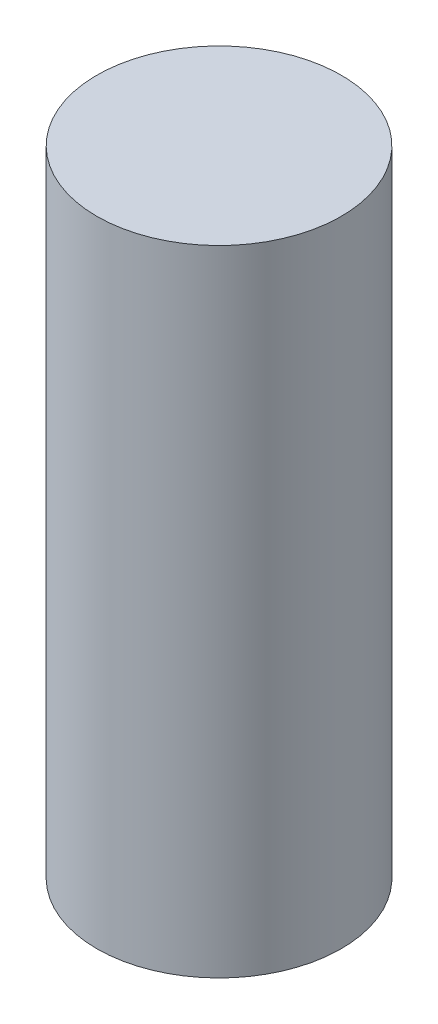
ISO-10303-21;
HEADER;
FILE_DESCRIPTION(('STEP AP214'),'2;1');
FILE_NAME('part.step','',(''),(''),'','','');
FILE_SCHEMA(('AUTOMOTIVE_DESIGN { 1 0 10303 214 1 1 1 1 }'));
ENDSEC;
DATA;
#1=APPLICATION_CONTEXT('core data for automotive mechanical design processes');
#2=APPLICATION_PROTOCOL_DEFINITION('international standard','automotive_design',2000,#1);
#3=PRODUCT_CONTEXT('',#1,'mechanical');
#4=PRODUCT('Part','Part','',(#3));
#5=PRODUCT_RELATED_PRODUCT_CATEGORY('part','',(#4));
#6=PRODUCT_DEFINITION_FORMATION('','',#4);
#7=PRODUCT_DEFINITION_CONTEXT('part definition',#1,'design');
#8=PRODUCT_DEFINITION('design','',#6,#7);
#9=PRODUCT_DEFINITION_SHAPE('','',#8);
#10=(LENGTH_UNIT() NAMED_UNIT(*) SI_UNIT(.MILLI.,.METRE.));
#11=(NAMED_UNIT(*) PLANE_ANGLE_UNIT() SI_UNIT($,.RADIAN.));
#12=(NAMED_UNIT(*) SI_UNIT($,.STERADIAN.) SOLID_ANGLE_UNIT());
#13=UNCERTAINTY_MEASURE_WITH_UNIT(LENGTH_MEASURE(1.E-05),#10,'distance_accuracy_value','');
#14=(GEOMETRIC_REPRESENTATION_CONTEXT(3) GLOBAL_UNCERTAINTY_ASSIGNED_CONTEXT((#13)) GLOBAL_UNIT_ASSIGNED_CONTEXT((#10,
#11,#12)) REPRESENTATION_CONTEXT('',''));
#15=CARTESIAN_POINT('',(0.,0.,0.));
#16=DIRECTION('',(0.,0.,1.));
#17=DIRECTION('',(1.,0.,0.));
#18=AXIS2_PLACEMENT_3D('',#15,#16,#17);
#19=CARTESIAN_POINT('',(0.,48.,0.));
#20=DIRECTION('',(0.,-1.,0.));
#21=DIRECTION('',(0.,0.,-1.));
#22=AXIS2_PLACEMENT_3D('',#19,#20,#21);
#23=CYLINDRICAL_SURFACE('',#22,9.25);
#24=CARTESIAN_POINT('',(0.,48.,0.));
#25=DIRECTION('',(0.,1.,0.));
#26=DIRECTION('',(0.,0.,1.));
#27=AXIS2_PLACEMENT_3D('',#24,#25,#26);
#28=CIRCLE('',#27,9.25);
#29=CARTESIAN_POINT('',(0.,48.,9.25));
#30=VERTEX_POINT('',#29);
#31=EDGE_CURVE('E10',#30,#30,#28,.T.);
#32=ORIENTED_EDGE('',*,*,#31,.F.);
#33=EDGE_LOOP('',(#32));
#34=FACE_BOUND('',#33,.T.);
#35=CARTESIAN_POINT('',(0.,0.,0.));
#36=DIRECTION('',(0.,1.,0.));
#37=DIRECTION('',(0.,0.,1.));
#38=AXIS2_PLACEMENT_3D('',#35,#36,#37);
#39=CIRCLE('',#38,9.25);
#40=CARTESIAN_POINT('',(0.,0.,9.25));
#41=VERTEX_POINT('',#40);
#42=EDGE_CURVE('E46',#41,#41,#39,.T.);
#43=ORIENTED_EDGE('',*,*,#42,.T.);
#44=EDGE_LOOP('',(#43));
#45=FACE_BOUND('',#44,.T.);
#46=ADVANCED_FACE('F43',(#34,#45),#23,.T.);
#47=CARTESIAN_POINT('',(0.,48.,0.));
#48=DIRECTION('',(0.,1.,0.));
#49=DIRECTION('',(0.,0.,1.));
#50=AXIS2_PLACEMENT_3D('',#47,#48,#49);
#51=PLANE('',#50);
#52=ORIENTED_EDGE('',*,*,#31,.T.);
#53=EDGE_LOOP('',(#52));
#54=FACE_BOUND('',#53,.T.);
#55=ADVANCED_FACE('F59',(#54),#51,.T.);
#56=CARTESIAN_POINT('',(0.,0.,0.));
#57=DIRECTION('',(0.,1.,0.));
#58=DIRECTION('',(0.,0.,1.));
#59=AXIS2_PLACEMENT_3D('',#56,#57,#58);
#60=PLANE('',#59);
#61=ORIENTED_EDGE('',*,*,#42,.F.);
#62=EDGE_LOOP('',(#61));
#63=FACE_BOUND('',#62,.T.);
#64=ADVANCED_FACE('F57',(#63),#60,.F.);
#65=CLOSED_SHELL('',(#46,#55,#64));
#66=MANIFOLD_SOLID_BREP('B2',#65);
#67=ADVANCED_BREP_SHAPE_REPRESENTATION('',(#18,#66),#14);
#68=SHAPE_DEFINITION_REPRESENTATION(#9,#67);
ENDSEC;
END-ISO-10303-21;
